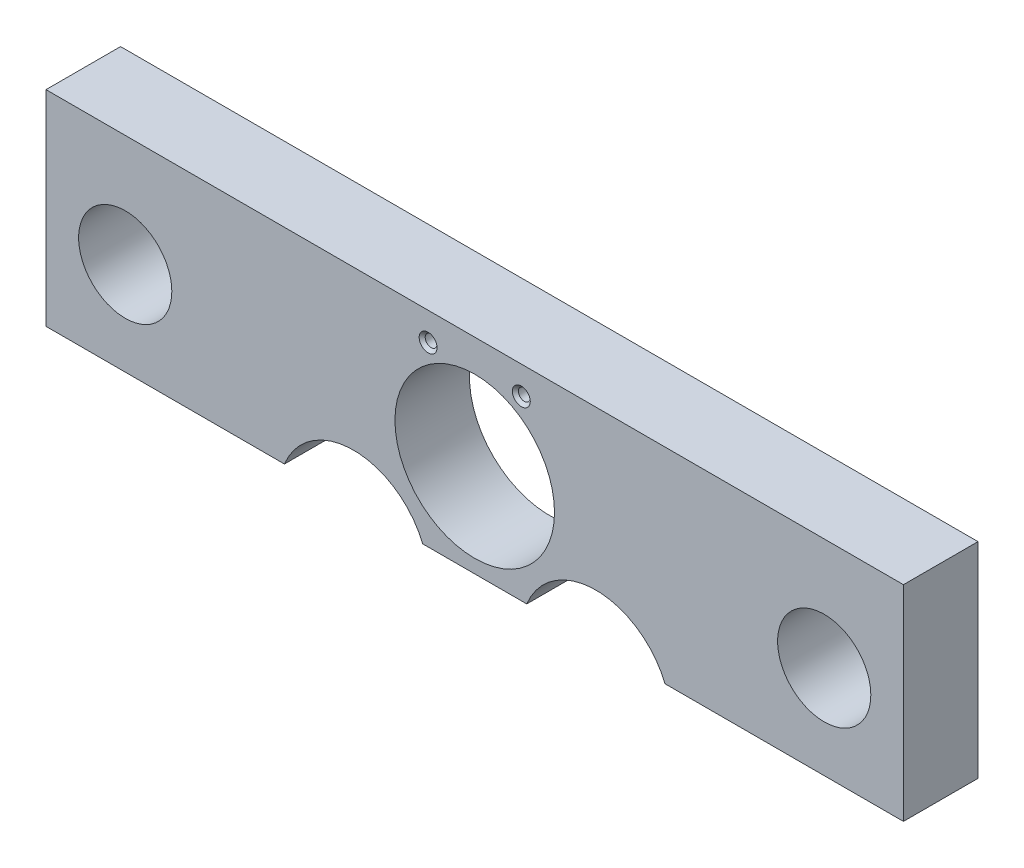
ISO-10303-21;
HEADER;
FILE_DESCRIPTION(('STEP AP214'),'2;1');
FILE_NAME('part.step','',(''),(''),'','','');
FILE_SCHEMA(('AUTOMOTIVE_DESIGN { 1 0 10303 214 1 1 1 1 }'));
ENDSEC;
DATA;
#1=APPLICATION_CONTEXT('core data for automotive mechanical design processes');
#2=APPLICATION_PROTOCOL_DEFINITION('international standard','automotive_design',2000,#1);
#3=PRODUCT_CONTEXT('',#1,'mechanical');
#4=PRODUCT('Part','Part','',(#3));
#5=PRODUCT_RELATED_PRODUCT_CATEGORY('part','',(#4));
#6=PRODUCT_DEFINITION_FORMATION('','',#4);
#7=PRODUCT_DEFINITION_CONTEXT('part definition',#1,'design');
#8=PRODUCT_DEFINITION('design','',#6,#7);
#9=PRODUCT_DEFINITION_SHAPE('','',#8);
#10=(LENGTH_UNIT() NAMED_UNIT(*) SI_UNIT(.MILLI.,.METRE.));
#11=(NAMED_UNIT(*) PLANE_ANGLE_UNIT() SI_UNIT($,.RADIAN.));
#12=(NAMED_UNIT(*) SI_UNIT($,.STERADIAN.) SOLID_ANGLE_UNIT());
#13=UNCERTAINTY_MEASURE_WITH_UNIT(LENGTH_MEASURE(1.E-05),#10,'distance_accuracy_value','');
#14=(GEOMETRIC_REPRESENTATION_CONTEXT(3) GLOBAL_UNCERTAINTY_ASSIGNED_CONTEXT((#13)) GLOBAL_UNIT_ASSIGNED_CONTEXT((#10,
#11,#12)) REPRESENTATION_CONTEXT('',''));
#15=CARTESIAN_POINT('',(0.,0.,0.));
#16=DIRECTION('',(0.,0.,1.));
#17=DIRECTION('',(1.,0.,0.));
#18=AXIS2_PLACEMENT_3D('',#15,#16,#17);
#19=CARTESIAN_POINT('',(0.,0.,25.4));
#20=DIRECTION('',(1.,0.,0.));
#21=DIRECTION('',(0.,0.,-1.));
#22=AXIS2_PLACEMENT_3D('',#19,#20,#21);
#23=PLANE('',#22);
#24=DIRECTION('',(0.,-1.,0.));
#25=VECTOR('',#24,1.);
#26=CARTESIAN_POINT('',(0.,0.,0.));
#27=LINE('',#26,#25);
#28=CARTESIAN_POINT('',(0.,76.2,0.));
#29=VERTEX_POINT('',#28);
#30=CARTESIAN_POINT('',(0.,6.35,0.));
#31=VERTEX_POINT('',#30);
#32=EDGE_CURVE('E136',#29,#31,#27,.T.);
#33=ORIENTED_EDGE('',*,*,#32,.T.);
#34=DIRECTION('',(0.,0.,1.));
#35=VECTOR('',#34,1.);
#36=CARTESIAN_POINT('',(0.,6.35,0.));
#37=LINE('',#36,#35);
#38=CARTESIAN_POINT('',(0.,6.35,25.4));
#39=VERTEX_POINT('',#38);
#40=EDGE_CURVE('E127',#31,#39,#37,.T.);
#41=ORIENTED_EDGE('',*,*,#40,.T.);
#42=DIRECTION('',(0.,-1.,0.));
#43=VECTOR('',#42,1.);
#44=CARTESIAN_POINT('',(0.,0.,25.4));
#45=LINE('',#44,#43);
#46=CARTESIAN_POINT('',(0.,76.2,25.4));
#47=VERTEX_POINT('',#46);
#48=EDGE_CURVE('E140',#47,#39,#45,.T.);
#49=ORIENTED_EDGE('',*,*,#48,.F.);
#50=DIRECTION('',(0.,0.,-1.));
#51=VECTOR('',#50,1.);
#52=CARTESIAN_POINT('',(0.,76.2,25.4));
#53=LINE('',#52,#51);
#54=EDGE_CURVE('E147',#47,#29,#53,.T.);
#55=ORIENTED_EDGE('',*,*,#54,.T.);
#56=EDGE_LOOP('',(#33,#41,#49,#55));
#57=FACE_BOUND('',#56,.T.);
#58=ADVANCED_FACE('F43',(#57),#23,.F.);
#59=CARTESIAN_POINT('',(292.1,0.,25.4));
#60=DIRECTION('',(-1.,0.,0.));
#61=DIRECTION('',(0.,0.,1.));
#62=AXIS2_PLACEMENT_3D('',#59,#60,#61);
#63=PLANE('',#62);
#64=DIRECTION('',(0.,1.,0.));
#65=VECTOR('',#64,1.);
#66=CARTESIAN_POINT('',(292.1,0.,25.4));
#67=LINE('',#66,#65);
#68=CARTESIAN_POINT('',(292.1,6.35,25.4));
#69=VERTEX_POINT('',#68);
#70=CARTESIAN_POINT('',(292.1,76.2,25.4));
#71=VERTEX_POINT('',#70);
#72=EDGE_CURVE('E125',#69,#71,#67,.T.);
#73=ORIENTED_EDGE('',*,*,#72,.F.);
#74=DIRECTION('',(0.,0.,1.));
#75=VECTOR('',#74,1.);
#76=CARTESIAN_POINT('',(292.1,6.35,0.));
#77=LINE('',#76,#75);
#78=CARTESIAN_POINT('',(292.1,6.35,0.));
#79=VERTEX_POINT('',#78);
#80=EDGE_CURVE('E109',#79,#69,#77,.T.);
#81=ORIENTED_EDGE('',*,*,#80,.F.);
#82=DIRECTION('',(0.,1.,0.));
#83=VECTOR('',#82,1.);
#84=CARTESIAN_POINT('',(292.1,0.,0.));
#85=LINE('',#84,#83);
#86=CARTESIAN_POINT('',(292.1,76.2,0.));
#87=VERTEX_POINT('',#86);
#88=EDGE_CURVE('E123',#79,#87,#85,.T.);
#89=ORIENTED_EDGE('',*,*,#88,.T.);
#90=DIRECTION('',(0.,0.,-1.));
#91=VECTOR('',#90,1.);
#92=CARTESIAN_POINT('',(292.1,76.2,25.4));
#93=LINE('',#92,#91);
#94=EDGE_CURVE('E151',#71,#87,#93,.T.);
#95=ORIENTED_EDGE('',*,*,#94,.F.);
#96=EDGE_LOOP('',(#73,#81,#89,#95));
#97=FACE_BOUND('',#96,.T.);
#98=ADVANCED_FACE('F121',(#97),#63,.F.);
#99=CARTESIAN_POINT('',(0.,76.2,25.4));
#100=DIRECTION('',(0.,-1.,0.));
#101=DIRECTION('',(0.,0.,-1.));
#102=AXIS2_PLACEMENT_3D('',#99,#100,#101);
#103=PLANE('',#102);
#104=DIRECTION('',(-1.,0.,0.));
#105=VECTOR('',#104,1.);
#106=CARTESIAN_POINT('',(0.,76.2,0.));
#107=LINE('',#106,#105);
#108=EDGE_CURVE('E134',#87,#29,#107,.T.);
#109=ORIENTED_EDGE('',*,*,#108,.T.);
#110=ORIENTED_EDGE('',*,*,#54,.F.);
#111=DIRECTION('',(-1.,0.,0.));
#112=VECTOR('',#111,1.);
#113=CARTESIAN_POINT('',(0.,76.2,25.4));
#114=LINE('',#113,#112);
#115=EDGE_CURVE('E152',#71,#47,#114,.T.);
#116=ORIENTED_EDGE('',*,*,#115,.F.);
#117=ORIENTED_EDGE('',*,*,#94,.T.);
#118=EDGE_LOOP('',(#109,#110,#116,#117));
#119=FACE_BOUND('',#118,.T.);
#120=ADVANCED_FACE('F214',(#119),#103,.F.);
#121=CARTESIAN_POINT('',(0.,0.,25.4));
#122=DIRECTION('',(0.,0.,-1.));
#123=DIRECTION('',(-1.,0.,0.));
#124=AXIS2_PLACEMENT_3D('',#121,#122,#123);
#125=PLANE('',#124);
#126=CARTESIAN_POINT('',(130.175,66.675,25.4));
#127=DIRECTION('',(0.,0.,1.));
#128=DIRECTION('',(1.,0.,0.));
#129=AXIS2_PLACEMENT_3D('',#126,#127,#128);
#130=CIRCLE('',#129,3.048);
#131=CARTESIAN_POINT('',(133.223,66.675,25.4));
#132=VERTEX_POINT('',#131);
#133=EDGE_CURVE('E260',#132,#132,#130,.T.);
#134=ORIENTED_EDGE('',*,*,#133,.F.);
#135=EDGE_LOOP('',(#134));
#136=FACE_BOUND('',#135,.T.);
#137=CARTESIAN_POINT('',(161.925,66.675,25.4));
#138=DIRECTION('',(0.,0.,1.));
#139=DIRECTION('',(1.,0.,0.));
#140=AXIS2_PLACEMENT_3D('',#137,#138,#139);
#141=CIRCLE('',#140,3.048);
#142=CARTESIAN_POINT('',(164.973,66.675,25.4));
#143=VERTEX_POINT('',#142);
#144=EDGE_CURVE('E242',#143,#143,#141,.T.);
#145=ORIENTED_EDGE('',*,*,#144,.F.);
#146=EDGE_LOOP('',(#145));
#147=FACE_BOUND('',#146,.T.);
#148=CARTESIAN_POINT('',(26.9875,38.1,25.4));
#149=DIRECTION('',(0.,0.,1.));
#150=DIRECTION('',(1.,0.,0.));
#151=AXIS2_PLACEMENT_3D('',#148,#149,#150);
#152=CIRCLE('',#151,15.875);
#153=CARTESIAN_POINT('',(42.8625,38.1,25.4));
#154=VERTEX_POINT('',#153);
#155=EDGE_CURVE('E176',#154,#154,#152,.T.);
#156=ORIENTED_EDGE('',*,*,#155,.F.);
#157=EDGE_LOOP('',(#156));
#158=FACE_BOUND('',#157,.T.);
#159=CARTESIAN_POINT('',(265.1125,38.1,25.4));
#160=DIRECTION('',(0.,0.,1.));
#161=DIRECTION('',(1.,0.,0.));
#162=AXIS2_PLACEMENT_3D('',#159,#160,#161);
#163=CIRCLE('',#162,15.875);
#164=CARTESIAN_POINT('',(280.9875,38.1,25.4));
#165=VERTEX_POINT('',#164);
#166=EDGE_CURVE('E191',#165,#165,#163,.T.);
#167=ORIENTED_EDGE('',*,*,#166,.F.);
#168=EDGE_LOOP('',(#167));
#169=FACE_BOUND('',#168,.T.);
#170=CARTESIAN_POINT('',(146.05,38.1,25.4));
#171=DIRECTION('',(0.,0.,-1.));
#172=DIRECTION('',(-1.,0.,0.));
#173=AXIS2_PLACEMENT_3D('',#170,#171,#172);
#174=CIRCLE('',#173,27.178);
#175=CARTESIAN_POINT('',(118.872,38.1,25.4));
#176=VERTEX_POINT('',#175);
#177=EDGE_CURVE('E143',#176,#176,#174,.T.);
#178=ORIENTED_EDGE('',*,*,#177,.T.);
#179=EDGE_LOOP('',(#178));
#180=FACE_BOUND('',#179,.T.);
#181=ORIENTED_EDGE('',*,*,#48,.T.);
#182=DIRECTION('',(1.,0.,0.));
#183=VECTOR('',#182,1.);
#184=CARTESIAN_POINT('',(0.,6.35,25.4));
#185=LINE('',#184,#183);
#186=CARTESIAN_POINT('',(81.2285698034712,6.35,25.4));
#187=VERTEX_POINT('',#186);
#188=EDGE_CURVE('E170',#39,#187,#185,.T.);
#189=ORIENTED_EDGE('',*,*,#188,.T.);
#190=CARTESIAN_POINT('',(104.775,-3.175,25.4));
#191=DIRECTION('',(0.,0.,1.));
#192=DIRECTION('',(1.,0.,0.));
#193=AXIS2_PLACEMENT_3D('',#190,#191,#192);
#194=CIRCLE('',#193,25.4);
#195=CARTESIAN_POINT('',(128.321430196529,6.35,25.4));
#196=VERTEX_POINT('',#195);
#197=EDGE_CURVE('E160',#196,#187,#194,.T.);
#198=ORIENTED_EDGE('',*,*,#197,.F.);
#199=CARTESIAN_POINT('',(163.778569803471,6.35,25.4));
#200=VERTEX_POINT('',#199);
#201=EDGE_CURVE('E66',#196,#200,#185,.T.);
#202=ORIENTED_EDGE('',*,*,#201,.T.);
#203=CARTESIAN_POINT('',(187.325,-3.175,25.4));
#204=DIRECTION('',(0.,0.,1.));
#205=DIRECTION('',(1.,0.,0.));
#206=AXIS2_PLACEMENT_3D('',#203,#204,#205);
#207=CIRCLE('',#206,25.4);
#208=CARTESIAN_POINT('',(210.871430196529,6.35,25.4));
#209=VERTEX_POINT('',#208);
#210=EDGE_CURVE('E178',#209,#200,#207,.T.);
#211=ORIENTED_EDGE('',*,*,#210,.F.);
#212=EDGE_CURVE('E58',#209,#69,#185,.T.);
#213=ORIENTED_EDGE('',*,*,#212,.T.);
#214=ORIENTED_EDGE('',*,*,#72,.T.);
#215=ORIENTED_EDGE('',*,*,#115,.T.);
#216=EDGE_LOOP('',(#181,#189,#198,#202,#211,#213,#214,#215));
#217=FACE_BOUND('',#216,.T.);
#218=ADVANCED_FACE('F167',(#136,#147,#158,#169,#180,#217),#125,.F.);
#219=CARTESIAN_POINT('',(0.,0.,0.));
#220=DIRECTION('',(0.,0.,-1.));
#221=DIRECTION('',(-1.,0.,0.));
#222=AXIS2_PLACEMENT_3D('',#219,#220,#221);
#223=PLANE('',#222);
#224=CARTESIAN_POINT('',(130.175,66.675,0.));
#225=DIRECTION('',(0.,0.,1.));
#226=DIRECTION('',(1.,0.,0.));
#227=AXIS2_PLACEMENT_3D('',#224,#225,#226);
#228=CIRCLE('',#227,3.048);
#229=CARTESIAN_POINT('',(133.223,66.675,0.));
#230=VERTEX_POINT('',#229);
#231=EDGE_CURVE('E264',#230,#230,#228,.T.);
#232=ORIENTED_EDGE('',*,*,#231,.T.);
#233=EDGE_LOOP('',(#232));
#234=FACE_BOUND('',#233,.T.);
#235=CARTESIAN_POINT('',(161.925,66.675,0.));
#236=DIRECTION('',(0.,0.,1.));
#237=DIRECTION('',(1.,0.,0.));
#238=AXIS2_PLACEMENT_3D('',#235,#236,#237);
#239=CIRCLE('',#238,3.048);
#240=CARTESIAN_POINT('',(164.973,66.675,0.));
#241=VERTEX_POINT('',#240);
#242=EDGE_CURVE('E248',#241,#241,#239,.T.);
#243=ORIENTED_EDGE('',*,*,#242,.T.);
#244=EDGE_LOOP('',(#243));
#245=FACE_BOUND('',#244,.T.);
#246=DIRECTION('',(-1.,0.,0.));
#247=VECTOR('',#246,1.);
#248=CARTESIAN_POINT('',(0.,6.35,0.));
#249=LINE('',#248,#247);
#250=CARTESIAN_POINT('',(81.2285698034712,6.35,0.));
#251=VERTEX_POINT('',#250);
#252=EDGE_CURVE('E118',#251,#31,#249,.T.);
#253=ORIENTED_EDGE('',*,*,#252,.T.);
#254=ORIENTED_EDGE('',*,*,#32,.F.);
#255=ORIENTED_EDGE('',*,*,#108,.F.);
#256=ORIENTED_EDGE('',*,*,#88,.F.);
#257=CARTESIAN_POINT('',(210.871430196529,6.35,0.));
#258=VERTEX_POINT('',#257);
#259=EDGE_CURVE('E106',#79,#258,#249,.T.);
#260=ORIENTED_EDGE('',*,*,#259,.T.);
#261=CARTESIAN_POINT('',(187.325,-3.175,0.));
#262=DIRECTION('',(0.,0.,1.));
#263=DIRECTION('',(1.,0.,0.));
#264=AXIS2_PLACEMENT_3D('',#261,#262,#263);
#265=CIRCLE('',#264,25.4);
#266=CARTESIAN_POINT('',(163.778569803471,6.35,0.));
#267=VERTEX_POINT('',#266);
#268=EDGE_CURVE('E172',#258,#267,#265,.T.);
#269=ORIENTED_EDGE('',*,*,#268,.T.);
#270=CARTESIAN_POINT('',(128.321430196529,6.35,0.));
#271=VERTEX_POINT('',#270);
#272=EDGE_CURVE('E116',#267,#271,#249,.T.);
#273=ORIENTED_EDGE('',*,*,#272,.T.);
#274=CARTESIAN_POINT('',(104.775,-3.175,0.));
#275=DIRECTION('',(0.,0.,1.));
#276=DIRECTION('',(1.,0.,0.));
#277=AXIS2_PLACEMENT_3D('',#274,#275,#276);
#278=CIRCLE('',#277,25.4);
#279=EDGE_CURVE('E162',#271,#251,#278,.T.);
#280=ORIENTED_EDGE('',*,*,#279,.T.);
#281=EDGE_LOOP('',(#253,#254,#255,#256,#260,#269,#273,#280));
#282=FACE_BOUND('',#281,.T.);
#283=CARTESIAN_POINT('',(26.9875,38.1,0.));
#284=DIRECTION('',(0.,0.,1.));
#285=DIRECTION('',(1.,0.,0.));
#286=AXIS2_PLACEMENT_3D('',#283,#284,#285);
#287=CIRCLE('',#286,15.875);
#288=CARTESIAN_POINT('',(42.8625,38.1,0.));
#289=VERTEX_POINT('',#288);
#290=EDGE_CURVE('E187',#289,#289,#287,.T.);
#291=ORIENTED_EDGE('',*,*,#290,.T.);
#292=EDGE_LOOP('',(#291));
#293=FACE_BOUND('',#292,.T.);
#294=CARTESIAN_POINT('',(265.1125,38.1,0.));
#295=DIRECTION('',(0.,0.,1.));
#296=DIRECTION('',(1.,0.,0.));
#297=AXIS2_PLACEMENT_3D('',#294,#295,#296);
#298=CIRCLE('',#297,15.875);
#299=CARTESIAN_POINT('',(280.9875,38.1,0.));
#300=VERTEX_POINT('',#299);
#301=EDGE_CURVE('E195',#300,#300,#298,.T.);
#302=ORIENTED_EDGE('',*,*,#301,.T.);
#303=EDGE_LOOP('',(#302));
#304=FACE_BOUND('',#303,.T.);
#305=CARTESIAN_POINT('',(146.05,38.1,0.));
#306=DIRECTION('',(0.,0.,1.));
#307=DIRECTION('',(1.,0.,0.));
#308=AXIS2_PLACEMENT_3D('',#305,#306,#307);
#309=CIRCLE('',#308,27.178);
#310=CARTESIAN_POINT('',(173.228,38.1,0.));
#311=VERTEX_POINT('',#310);
#312=EDGE_CURVE('E199',#311,#311,#309,.T.);
#313=ORIENTED_EDGE('',*,*,#312,.T.);
#314=EDGE_LOOP('',(#313));
#315=FACE_BOUND('',#314,.T.);
#316=ADVANCED_FACE('F131',(#234,#245,#282,#293,#304,#315),#223,.T.);
#317=CARTESIAN_POINT('',(146.05,38.1,0.));
#318=DIRECTION('',(0.,0.,1.));
#319=DIRECTION('',(1.,0.,0.));
#320=AXIS2_PLACEMENT_3D('',#317,#318,#319);
#321=CYLINDRICAL_SURFACE('',#320,27.178);
#322=ORIENTED_EDGE('',*,*,#312,.F.);
#323=EDGE_LOOP('',(#322));
#324=FACE_BOUND('',#323,.T.);
#325=ORIENTED_EDGE('',*,*,#177,.F.);
#326=EDGE_LOOP('',(#325));
#327=FACE_BOUND('',#326,.T.);
#328=ADVANCED_FACE('F301',(#324,#327),#321,.F.);
#329=CARTESIAN_POINT('',(265.1125,38.1,25.4));
#330=DIRECTION('',(0.,0.,1.));
#331=DIRECTION('',(1.,0.,0.));
#332=AXIS2_PLACEMENT_3D('',#329,#330,#331);
#333=CYLINDRICAL_SURFACE('',#332,15.875);
#334=ORIENTED_EDGE('',*,*,#301,.F.);
#335=EDGE_LOOP('',(#334));
#336=FACE_BOUND('',#335,.T.);
#337=ORIENTED_EDGE('',*,*,#166,.T.);
#338=EDGE_LOOP('',(#337));
#339=FACE_BOUND('',#338,.T.);
#340=ADVANCED_FACE('F303',(#336,#339),#333,.F.);
#341=CARTESIAN_POINT('',(26.9875,38.1,25.4));
#342=DIRECTION('',(0.,0.,1.));
#343=DIRECTION('',(1.,0.,0.));
#344=AXIS2_PLACEMENT_3D('',#341,#342,#343);
#345=CYLINDRICAL_SURFACE('',#344,15.875);
#346=ORIENTED_EDGE('',*,*,#290,.F.);
#347=EDGE_LOOP('',(#346));
#348=FACE_BOUND('',#347,.T.);
#349=ORIENTED_EDGE('',*,*,#155,.T.);
#350=EDGE_LOOP('',(#349));
#351=FACE_BOUND('',#350,.T.);
#352=ADVANCED_FACE('F310',(#348,#351),#345,.F.);
#353=CARTESIAN_POINT('',(187.325,-3.175,0.));
#354=DIRECTION('',(0.,0.,1.));
#355=DIRECTION('',(1.,0.,0.));
#356=AXIS2_PLACEMENT_3D('',#353,#354,#355);
#357=CYLINDRICAL_SURFACE('',#356,25.4);
#358=ORIENTED_EDGE('',*,*,#210,.T.);
#359=DIRECTION('',(0.,0.,1.));
#360=VECTOR('',#359,1.);
#361=CARTESIAN_POINT('',(163.778569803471,6.35,0.));
#362=LINE('',#361,#360);
#363=EDGE_CURVE('E221',#200,#267,#362,.F.);
#364=ORIENTED_EDGE('',*,*,#363,.T.);
#365=ORIENTED_EDGE('',*,*,#268,.F.);
#366=DIRECTION('',(0.,0.,1.));
#367=VECTOR('',#366,1.);
#368=CARTESIAN_POINT('',(210.871430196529,6.35,0.));
#369=LINE('',#368,#367);
#370=EDGE_CURVE('E110',#258,#209,#369,.T.);
#371=ORIENTED_EDGE('',*,*,#370,.T.);
#372=EDGE_LOOP('',(#358,#364,#365,#371));
#373=FACE_BOUND('',#372,.T.);
#374=ADVANCED_FACE('F231',(#373),#357,.F.);
#375=CARTESIAN_POINT('',(104.775,-3.175,0.));
#376=DIRECTION('',(0.,0.,1.));
#377=DIRECTION('',(1.,0.,0.));
#378=AXIS2_PLACEMENT_3D('',#375,#376,#377);
#379=CYLINDRICAL_SURFACE('',#378,25.4);
#380=ORIENTED_EDGE('',*,*,#197,.T.);
#381=DIRECTION('',(0.,0.,1.));
#382=VECTOR('',#381,1.);
#383=CARTESIAN_POINT('',(81.2285698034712,6.35,0.));
#384=LINE('',#383,#382);
#385=EDGE_CURVE('E11',#187,#251,#384,.F.);
#386=ORIENTED_EDGE('',*,*,#385,.T.);
#387=ORIENTED_EDGE('',*,*,#279,.F.);
#388=DIRECTION('',(0.,0.,1.));
#389=VECTOR('',#388,1.);
#390=CARTESIAN_POINT('',(128.321430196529,6.35,0.));
#391=LINE('',#390,#389);
#392=EDGE_CURVE('E51',#271,#196,#391,.T.);
#393=ORIENTED_EDGE('',*,*,#392,.T.);
#394=EDGE_LOOP('',(#380,#386,#387,#393));
#395=FACE_BOUND('',#394,.T.);
#396=ADVANCED_FACE('F159',(#395),#379,.F.);
#397=CARTESIAN_POINT('',(0.,6.35,0.));
#398=DIRECTION('',(0.,1.,0.));
#399=DIRECTION('',(0.,0.,1.));
#400=AXIS2_PLACEMENT_3D('',#397,#398,#399);
#401=PLANE('',#400);
#402=ORIENTED_EDGE('',*,*,#201,.F.);
#403=ORIENTED_EDGE('',*,*,#392,.F.);
#404=ORIENTED_EDGE('',*,*,#272,.F.);
#405=ORIENTED_EDGE('',*,*,#363,.F.);
#406=EDGE_LOOP('',(#402,#403,#404,#405));
#407=FACE_BOUND('',#406,.T.);
#408=ADVANCED_FACE('F406',(#407),#401,.F.);
#409=ORIENTED_EDGE('',*,*,#40,.F.);
#410=ORIENTED_EDGE('',*,*,#252,.F.);
#411=ORIENTED_EDGE('',*,*,#385,.F.);
#412=ORIENTED_EDGE('',*,*,#188,.F.);
#413=EDGE_LOOP('',(#409,#410,#411,#412));
#414=FACE_BOUND('',#413,.T.);
#415=ADVANCED_FACE('F405',(#414),#401,.F.);
#416=ORIENTED_EDGE('',*,*,#370,.F.);
#417=ORIENTED_EDGE('',*,*,#259,.F.);
#418=ORIENTED_EDGE('',*,*,#80,.T.);
#419=ORIENTED_EDGE('',*,*,#212,.F.);
#420=EDGE_LOOP('',(#416,#417,#418,#419));
#421=FACE_BOUND('',#420,.T.);
#422=ADVANCED_FACE('F108',(#421),#401,.F.);
#423=CARTESIAN_POINT('',(161.925,66.675,1.0287));
#424=DIRECTION('',(0.,0.,-1.));
#425=DIRECTION('',(-1.,0.,0.));
#426=AXIS2_PLACEMENT_3D('',#423,#424,#425);
#427=CONICAL_SURFACE('',#426,2.0193,0.785398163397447);
#428=ORIENTED_EDGE('',*,*,#242,.F.);
#429=EDGE_LOOP('',(#428));
#430=FACE_BOUND('',#429,.T.);
#431=CARTESIAN_POINT('',(161.925,66.675,1.0287));
#432=DIRECTION('',(0.,0.,1.));
#433=DIRECTION('',(1.,0.,0.));
#434=AXIS2_PLACEMENT_3D('',#431,#432,#433);
#435=CIRCLE('',#434,2.0193);
#436=CARTESIAN_POINT('',(163.9443,66.675,1.0287));
#437=VERTEX_POINT('',#436);
#438=EDGE_CURVE('E234',#437,#437,#435,.T.);
#439=ORIENTED_EDGE('',*,*,#438,.T.);
#440=EDGE_LOOP('',(#439));
#441=FACE_BOUND('',#440,.T.);
#442=ADVANCED_FACE('F340',(#430,#441),#427,.F.);
#443=CARTESIAN_POINT('',(161.925,66.675,25.4));
#444=DIRECTION('',(0.,0.,1.));
#445=DIRECTION('',(1.,0.,0.));
#446=AXIS2_PLACEMENT_3D('',#443,#444,#445);
#447=CYLINDRICAL_SURFACE('',#446,2.0193);
#448=ORIENTED_EDGE('',*,*,#438,.F.);
#449=EDGE_LOOP('',(#448));
#450=FACE_BOUND('',#449,.T.);
#451=CARTESIAN_POINT('',(161.925,66.675,24.3713));
#452=DIRECTION('',(0.,0.,1.));
#453=DIRECTION('',(1.,0.,0.));
#454=AXIS2_PLACEMENT_3D('',#451,#452,#453);
#455=CIRCLE('',#454,2.0193);
#456=CARTESIAN_POINT('',(163.9443,66.675,24.3713));
#457=VERTEX_POINT('',#456);
#458=EDGE_CURVE('E237',#457,#457,#455,.T.);
#459=ORIENTED_EDGE('',*,*,#458,.T.);
#460=EDGE_LOOP('',(#459));
#461=FACE_BOUND('',#460,.T.);
#462=ADVANCED_FACE('F345',(#450,#461),#447,.F.);
#463=CARTESIAN_POINT('',(161.925,66.675,25.4));
#464=DIRECTION('',(0.,0.,1.));
#465=DIRECTION('',(1.,0.,0.));
#466=AXIS2_PLACEMENT_3D('',#463,#464,#465);
#467=CONICAL_SURFACE('',#466,3.048,0.785398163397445);
#468=ORIENTED_EDGE('',*,*,#458,.F.);
#469=EDGE_LOOP('',(#468));
#470=FACE_BOUND('',#469,.T.);
#471=ORIENTED_EDGE('',*,*,#144,.T.);
#472=EDGE_LOOP('',(#471));
#473=FACE_BOUND('',#472,.T.);
#474=ADVANCED_FACE('F275',(#470,#473),#467,.F.);
#475=CARTESIAN_POINT('',(130.175,66.675,1.0287));
#476=DIRECTION('',(0.,0.,-1.));
#477=DIRECTION('',(-1.,0.,0.));
#478=AXIS2_PLACEMENT_3D('',#475,#476,#477);
#479=CONICAL_SURFACE('',#478,2.0193,0.785398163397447);
#480=ORIENTED_EDGE('',*,*,#231,.F.);
#481=EDGE_LOOP('',(#480));
#482=FACE_BOUND('',#481,.T.);
#483=CARTESIAN_POINT('',(130.175,66.675,1.0287));
#484=DIRECTION('',(0.,0.,1.));
#485=DIRECTION('',(1.,0.,0.));
#486=AXIS2_PLACEMENT_3D('',#483,#484,#485);
#487=CIRCLE('',#486,2.0193);
#488=CARTESIAN_POINT('',(132.1943,66.675,1.0287));
#489=VERTEX_POINT('',#488);
#490=EDGE_CURVE('E252',#489,#489,#487,.T.);
#491=ORIENTED_EDGE('',*,*,#490,.T.);
#492=EDGE_LOOP('',(#491));
#493=FACE_BOUND('',#492,.T.);
#494=ADVANCED_FACE('F271',(#482,#493),#479,.F.);
#495=CARTESIAN_POINT('',(130.175,66.675,25.4));
#496=DIRECTION('',(0.,0.,1.));
#497=DIRECTION('',(1.,0.,0.));
#498=AXIS2_PLACEMENT_3D('',#495,#496,#497);
#499=CYLINDRICAL_SURFACE('',#498,2.0193);
#500=ORIENTED_EDGE('',*,*,#490,.F.);
#501=EDGE_LOOP('',(#500));
#502=FACE_BOUND('',#501,.T.);
#503=CARTESIAN_POINT('',(130.175,66.675,24.3713));
#504=DIRECTION('',(0.,0.,1.));
#505=DIRECTION('',(1.,0.,0.));
#506=AXIS2_PLACEMENT_3D('',#503,#504,#505);
#507=CIRCLE('',#506,2.0193);
#508=CARTESIAN_POINT('',(132.1943,66.675,24.3713));
#509=VERTEX_POINT('',#508);
#510=EDGE_CURVE('E256',#509,#509,#507,.T.);
#511=ORIENTED_EDGE('',*,*,#510,.T.);
#512=EDGE_LOOP('',(#511));
#513=FACE_BOUND('',#512,.T.);
#514=ADVANCED_FACE('F274',(#502,#513),#499,.F.);
#515=CARTESIAN_POINT('',(130.175,66.675,25.4));
#516=DIRECTION('',(0.,0.,1.));
#517=DIRECTION('',(1.,0.,0.));
#518=AXIS2_PLACEMENT_3D('',#515,#516,#517);
#519=CONICAL_SURFACE('',#518,3.048,0.785398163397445);
#520=ORIENTED_EDGE('',*,*,#510,.F.);
#521=EDGE_LOOP('',(#520));
#522=FACE_BOUND('',#521,.T.);
#523=ORIENTED_EDGE('',*,*,#133,.T.);
#524=EDGE_LOOP('',(#523));
#525=FACE_BOUND('',#524,.T.);
#526=ADVANCED_FACE('F281',(#522,#525),#519,.F.);
#527=CLOSED_SHELL('',(#58,#98,#120,#218,#316,#328,#340,#352,#374,#396,#408,#415,#422,#442,#462,
#474,#494,#514,#526));
#528=MANIFOLD_SOLID_BREP('B2',#527);
#529=ADVANCED_BREP_SHAPE_REPRESENTATION('',(#18,#528),#14);
#530=SHAPE_DEFINITION_REPRESENTATION(#9,#529);
ENDSEC;
END-ISO-10303-21;
